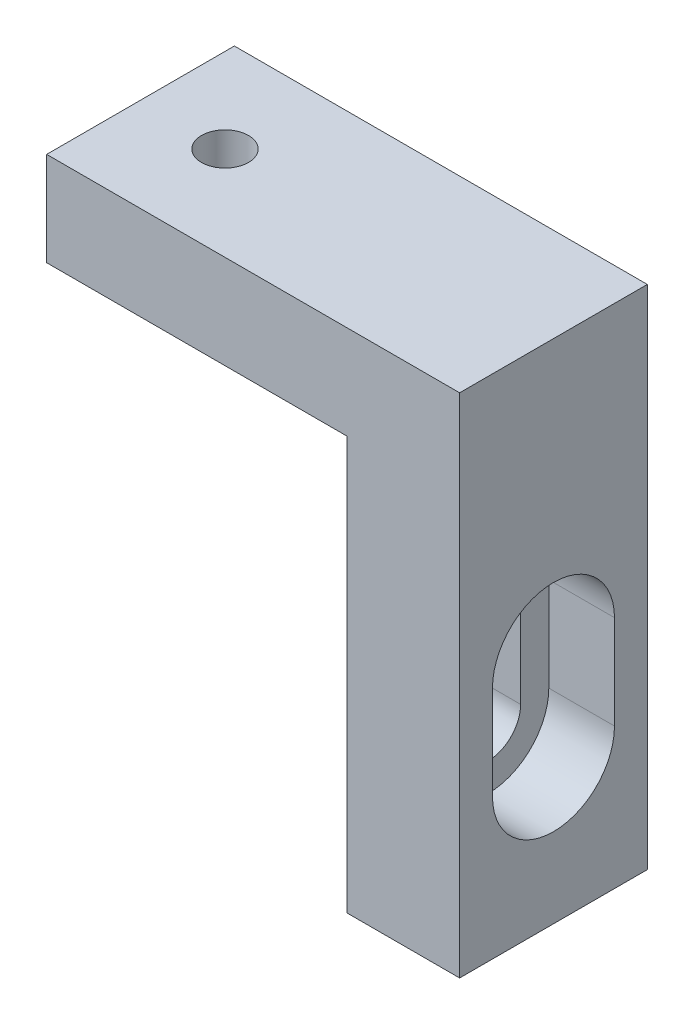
ISO-10303-21;
HEADER;
FILE_DESCRIPTION(('STEP AP214'),'2;1');
FILE_NAME('part.step','',(''),(''),'','','');
FILE_SCHEMA(('AUTOMOTIVE_DESIGN { 1 0 10303 214 1 1 1 1 }'));
ENDSEC;
DATA;
#1=APPLICATION_CONTEXT('core data for automotive mechanical design processes');
#2=APPLICATION_PROTOCOL_DEFINITION('international standard','automotive_design',2000,#1);
#3=PRODUCT_CONTEXT('',#1,'mechanical');
#4=PRODUCT('Part','Part','',(#3));
#5=PRODUCT_RELATED_PRODUCT_CATEGORY('part','',(#4));
#6=PRODUCT_DEFINITION_FORMATION('','',#4);
#7=PRODUCT_DEFINITION_CONTEXT('part definition',#1,'design');
#8=PRODUCT_DEFINITION('design','',#6,#7);
#9=PRODUCT_DEFINITION_SHAPE('','',#8);
#10=(LENGTH_UNIT() NAMED_UNIT(*) SI_UNIT(.MILLI.,.METRE.));
#11=(NAMED_UNIT(*) PLANE_ANGLE_UNIT() SI_UNIT($,.RADIAN.));
#12=(NAMED_UNIT(*) SI_UNIT($,.STERADIAN.) SOLID_ANGLE_UNIT());
#13=UNCERTAINTY_MEASURE_WITH_UNIT(LENGTH_MEASURE(1.E-05),#10,'distance_accuracy_value','');
#14=(GEOMETRIC_REPRESENTATION_CONTEXT(3) GLOBAL_UNCERTAINTY_ASSIGNED_CONTEXT((#13)) GLOBAL_UNIT_ASSIGNED_CONTEXT((#10,
#11,#12)) REPRESENTATION_CONTEXT('',''));
#15=CARTESIAN_POINT('',(0.,0.,0.));
#16=DIRECTION('',(0.,0.,1.));
#17=DIRECTION('',(1.,0.,0.));
#18=AXIS2_PLACEMENT_3D('',#15,#16,#17);
#19=CARTESIAN_POINT('',(12.0000000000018,7.49999999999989,5.));
#20=DIRECTION('',(1.,0.,0.));
#21=DIRECTION('',(0.,0.,-1.));
#22=AXIS2_PLACEMENT_3D('',#19,#20,#21);
#23=CYLINDRICAL_SURFACE('',#22,1.75);
#24=CARTESIAN_POINT('',(18.5000000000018,7.49999999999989,5.));
#25=DIRECTION('',(1.,0.,0.));
#26=DIRECTION('',(0.,0.,-1.));
#27=AXIS2_PLACEMENT_3D('',#24,#25,#26);
#28=CIRCLE('',#27,1.75);
#29=CARTESIAN_POINT('',(18.5000000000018,7.5,3.25));
#30=VERTEX_POINT('',#29);
#31=CARTESIAN_POINT('',(18.5000000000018,7.5,6.75));
#32=VERTEX_POINT('',#31);
#33=EDGE_CURVE('E176',#30,#32,#28,.F.);
#34=ORIENTED_EDGE('',*,*,#33,.F.);
#35=DIRECTION('',(1.,0.,0.));
#36=VECTOR('',#35,1.);
#37=CARTESIAN_POINT('',(12.0000000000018,7.5,3.25));
#38=LINE('',#37,#36);
#39=CARTESIAN_POINT('',(16.0000000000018,7.5,3.25));
#40=VERTEX_POINT('',#39);
#41=EDGE_CURVE('E178',#40,#30,#38,.T.);
#42=ORIENTED_EDGE('',*,*,#41,.F.);
#43=CARTESIAN_POINT('',(16.0000000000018,7.49999999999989,5.));
#44=DIRECTION('',(1.,0.,0.));
#45=DIRECTION('',(0.,0.,-1.));
#46=AXIS2_PLACEMENT_3D('',#43,#44,#45);
#47=CIRCLE('',#46,1.75);
#48=CARTESIAN_POINT('',(16.0000000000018,7.5,6.75));
#49=VERTEX_POINT('',#48);
#50=EDGE_CURVE('E41',#49,#40,#47,.T.);
#51=ORIENTED_EDGE('',*,*,#50,.F.);
#52=DIRECTION('',(1.,0.,0.));
#53=VECTOR('',#52,1.);
#54=CARTESIAN_POINT('',(12.0000000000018,7.5,6.75));
#55=LINE('',#54,#53);
#56=EDGE_CURVE('E179',#49,#32,#55,.T.);
#57=ORIENTED_EDGE('',*,*,#56,.T.);
#58=EDGE_LOOP('',(#34,#42,#51,#57));
#59=FACE_BOUND('',#58,.T.);
#60=ADVANCED_FACE('F32',(#59),#23,.F.);
#61=CARTESIAN_POINT('',(12.0000000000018,7.5,6.75));
#62=DIRECTION('',(0.,0.,1.));
#63=DIRECTION('',(1.,0.,0.));
#64=AXIS2_PLACEMENT_3D('',#61,#62,#63);
#65=PLANE('',#64);
#66=DIRECTION('',(0.,1.,0.));
#67=VECTOR('',#66,1.);
#68=CARTESIAN_POINT('',(18.5000000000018,7.5,6.75));
#69=LINE('',#68,#67);
#70=CARTESIAN_POINT('',(18.5000000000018,12.5,6.75));
#71=VERTEX_POINT('',#70);
#72=EDGE_CURVE('E174',#32,#71,#69,.T.);
#73=ORIENTED_EDGE('',*,*,#72,.F.);
#74=ORIENTED_EDGE('',*,*,#56,.F.);
#75=DIRECTION('',(0.,-1.,0.));
#76=VECTOR('',#75,1.);
#77=CARTESIAN_POINT('',(16.0000000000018,-4.54747350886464E-13,6.75));
#78=LINE('',#77,#76);
#79=CARTESIAN_POINT('',(16.0000000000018,12.5,6.75));
#80=VERTEX_POINT('',#79);
#81=EDGE_CURVE('E240',#80,#49,#78,.T.);
#82=ORIENTED_EDGE('',*,*,#81,.F.);
#83=DIRECTION('',(1.,0.,0.));
#84=VECTOR('',#83,1.);
#85=CARTESIAN_POINT('',(12.0000000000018,12.5,6.75));
#86=LINE('',#85,#84);
#87=EDGE_CURVE('E183',#80,#71,#86,.T.);
#88=ORIENTED_EDGE('',*,*,#87,.T.);
#89=EDGE_LOOP('',(#73,#74,#82,#88));
#90=FACE_BOUND('',#89,.T.);
#91=ADVANCED_FACE('F253',(#90),#65,.F.);
#92=CARTESIAN_POINT('',(12.0000000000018,12.4999999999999,5.));
#93=DIRECTION('',(1.,0.,0.));
#94=DIRECTION('',(0.,0.,-1.));
#95=AXIS2_PLACEMENT_3D('',#92,#93,#94);
#96=CYLINDRICAL_SURFACE('',#95,1.75);
#97=CARTESIAN_POINT('',(18.5000000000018,12.4999999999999,5.));
#98=DIRECTION('',(1.,0.,0.));
#99=DIRECTION('',(0.,0.,-1.));
#100=AXIS2_PLACEMENT_3D('',#97,#98,#99);
#101=CIRCLE('',#100,1.75);
#102=CARTESIAN_POINT('',(18.5000000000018,12.5,3.25));
#103=VERTEX_POINT('',#102);
#104=EDGE_CURVE('E55',#71,#103,#101,.F.);
#105=ORIENTED_EDGE('',*,*,#104,.F.);
#106=ORIENTED_EDGE('',*,*,#87,.F.);
#107=CARTESIAN_POINT('',(16.0000000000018,12.4999999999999,5.));
#108=DIRECTION('',(1.,0.,0.));
#109=DIRECTION('',(0.,0.,-1.));
#110=AXIS2_PLACEMENT_3D('',#107,#108,#109);
#111=CIRCLE('',#110,1.75);
#112=CARTESIAN_POINT('',(16.0000000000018,12.5,3.25));
#113=VERTEX_POINT('',#112);
#114=EDGE_CURVE('E237',#113,#80,#111,.T.);
#115=ORIENTED_EDGE('',*,*,#114,.F.);
#116=DIRECTION('',(1.,0.,0.));
#117=VECTOR('',#116,1.);
#118=CARTESIAN_POINT('',(12.0000000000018,12.5,3.25));
#119=LINE('',#118,#117);
#120=EDGE_CURVE('E186',#113,#103,#119,.T.);
#121=ORIENTED_EDGE('',*,*,#120,.T.);
#122=EDGE_LOOP('',(#105,#106,#115,#121));
#123=FACE_BOUND('',#122,.T.);
#124=ADVANCED_FACE('F256',(#123),#96,.F.);
#125=CARTESIAN_POINT('',(12.0000000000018,7.5,3.25));
#126=DIRECTION('',(0.,0.,-1.));
#127=DIRECTION('',(-1.,0.,0.));
#128=AXIS2_PLACEMENT_3D('',#125,#126,#127);
#129=PLANE('',#128);
#130=DIRECTION('',(0.,-1.,0.));
#131=VECTOR('',#130,1.);
#132=CARTESIAN_POINT('',(18.5000000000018,7.5,3.25));
#133=LINE('',#132,#131);
#134=EDGE_CURVE('E11',#103,#30,#133,.T.);
#135=ORIENTED_EDGE('',*,*,#134,.F.);
#136=ORIENTED_EDGE('',*,*,#120,.F.);
#137=DIRECTION('',(0.,1.,0.));
#138=VECTOR('',#137,1.);
#139=CARTESIAN_POINT('',(16.0000000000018,-4.54747350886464E-13,3.25));
#140=LINE('',#139,#138);
#141=EDGE_CURVE('E234',#40,#113,#140,.T.);
#142=ORIENTED_EDGE('',*,*,#141,.F.);
#143=ORIENTED_EDGE('',*,*,#41,.T.);
#144=EDGE_LOOP('',(#135,#136,#142,#143));
#145=FACE_BOUND('',#144,.T.);
#146=ADVANCED_FACE('F259',(#145),#129,.F.);
#147=CARTESIAN_POINT('',(16.0000000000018,-4.54747350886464E-13,10.));
#148=DIRECTION('',(0.,1.,0.));
#149=DIRECTION('',(0.,0.,1.));
#150=AXIS2_PLACEMENT_3D('',#147,#148,#149);
#151=PLANE('',#150);
#152=DIRECTION('',(1.,0.,0.));
#153=VECTOR('',#152,1.);
#154=CARTESIAN_POINT('',(16.0000000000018,-4.54747350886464E-13,0.));
#155=LINE('',#154,#153);
#156=CARTESIAN_POINT('',(16.0000000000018,-4.54747350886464E-13,0.));
#157=VERTEX_POINT('',#156);
#158=CARTESIAN_POINT('',(22.0000000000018,-4.54747350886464E-13,0.));
#159=VERTEX_POINT('',#158);
#160=EDGE_CURVE('E182',#157,#159,#155,.T.);
#161=ORIENTED_EDGE('',*,*,#160,.T.);
#162=DIRECTION('',(0.,0.,-1.));
#163=VECTOR('',#162,1.);
#164=CARTESIAN_POINT('',(22.0000000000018,-4.54747350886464E-13,10.));
#165=LINE('',#164,#163);
#166=CARTESIAN_POINT('',(22.0000000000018,-4.54747350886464E-13,10.));
#167=VERTEX_POINT('',#166);
#168=EDGE_CURVE('E231',#167,#159,#165,.T.);
#169=ORIENTED_EDGE('',*,*,#168,.F.);
#170=DIRECTION('',(1.,0.,0.));
#171=VECTOR('',#170,1.);
#172=CARTESIAN_POINT('',(16.0000000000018,-4.54747350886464E-13,10.));
#173=LINE('',#172,#171);
#174=CARTESIAN_POINT('',(16.0000000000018,-4.54747350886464E-13,10.));
#175=VERTEX_POINT('',#174);
#176=EDGE_CURVE('E191',#175,#167,#173,.T.);
#177=ORIENTED_EDGE('',*,*,#176,.F.);
#178=DIRECTION('',(0.,0.,-1.));
#179=VECTOR('',#178,1.);
#180=CARTESIAN_POINT('',(16.0000000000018,-4.54747350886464E-13,10.));
#181=LINE('',#180,#179);
#182=EDGE_CURVE('E205',#175,#157,#181,.T.);
#183=ORIENTED_EDGE('',*,*,#182,.T.);
#184=EDGE_LOOP('',(#161,#169,#177,#183));
#185=FACE_BOUND('',#184,.T.);
#186=ADVANCED_FACE('F34',(#185),#151,.F.);
#187=CARTESIAN_POINT('',(22.0000000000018,-4.54747350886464E-13,10.));
#188=DIRECTION('',(-1.,0.,0.));
#189=DIRECTION('',(0.,0.,1.));
#190=AXIS2_PLACEMENT_3D('',#187,#188,#189);
#191=PLANE('',#190);
#192=DIRECTION('',(0.,1.,0.));
#193=VECTOR('',#192,1.);
#194=CARTESIAN_POINT('',(22.0000000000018,7.5,1.75));
#195=LINE('',#194,#193);
#196=CARTESIAN_POINT('',(22.0000000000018,7.5,1.75));
#197=VERTEX_POINT('',#196);
#198=CARTESIAN_POINT('',(22.0000000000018,12.5,1.75));
#199=VERTEX_POINT('',#198);
#200=EDGE_CURVE('E164',#197,#199,#195,.T.);
#201=ORIENTED_EDGE('',*,*,#200,.F.);
#202=CARTESIAN_POINT('',(22.0000000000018,7.49999999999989,5.));
#203=DIRECTION('',(1.,0.,0.));
#204=DIRECTION('',(0.,0.,-1.));
#205=AXIS2_PLACEMENT_3D('',#202,#203,#204);
#206=CIRCLE('',#205,3.25);
#207=CARTESIAN_POINT('',(22.0000000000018,7.5,8.25));
#208=VERTEX_POINT('',#207);
#209=EDGE_CURVE('E48',#208,#197,#206,.T.);
#210=ORIENTED_EDGE('',*,*,#209,.F.);
#211=DIRECTION('',(0.,-1.,0.));
#212=VECTOR('',#211,1.);
#213=CARTESIAN_POINT('',(22.0000000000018,7.5,8.25));
#214=LINE('',#213,#212);
#215=CARTESIAN_POINT('',(22.0000000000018,12.5,8.25));
#216=VERTEX_POINT('',#215);
#217=EDGE_CURVE('E153',#216,#208,#214,.T.);
#218=ORIENTED_EDGE('',*,*,#217,.F.);
#219=CARTESIAN_POINT('',(22.0000000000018,12.4999999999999,5.));
#220=DIRECTION('',(1.,0.,0.));
#221=DIRECTION('',(0.,0.,-1.));
#222=AXIS2_PLACEMENT_3D('',#219,#220,#221);
#223=CIRCLE('',#222,3.25);
#224=EDGE_CURVE('E156',#199,#216,#223,.T.);
#225=ORIENTED_EDGE('',*,*,#224,.F.);
#226=EDGE_LOOP('',(#201,#210,#218,#225));
#227=FACE_BOUND('',#226,.T.);
#228=DIRECTION('',(0.,1.,0.));
#229=VECTOR('',#228,1.);
#230=CARTESIAN_POINT('',(22.0000000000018,-4.54747350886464E-13,0.));
#231=LINE('',#230,#229);
#232=CARTESIAN_POINT('',(22.0000000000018,26.9999999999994,0.));
#233=VERTEX_POINT('',#232);
#234=EDGE_CURVE('E208',#159,#233,#231,.T.);
#235=ORIENTED_EDGE('',*,*,#234,.T.);
#236=DIRECTION('',(0.,0.,-1.));
#237=VECTOR('',#236,1.);
#238=CARTESIAN_POINT('',(22.0000000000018,26.9999999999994,10.));
#239=LINE('',#238,#237);
#240=CARTESIAN_POINT('',(22.0000000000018,26.9999999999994,10.));
#241=VERTEX_POINT('',#240);
#242=EDGE_CURVE('E228',#241,#233,#239,.T.);
#243=ORIENTED_EDGE('',*,*,#242,.F.);
#244=DIRECTION('',(0.,1.,0.));
#245=VECTOR('',#244,1.);
#246=CARTESIAN_POINT('',(22.0000000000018,-4.54747350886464E-13,10.));
#247=LINE('',#246,#245);
#248=EDGE_CURVE('E194',#167,#241,#247,.T.);
#249=ORIENTED_EDGE('',*,*,#248,.F.);
#250=ORIENTED_EDGE('',*,*,#168,.T.);
#251=EDGE_LOOP('',(#235,#243,#249,#250));
#252=FACE_BOUND('',#251,.T.);
#253=ADVANCED_FACE('F266',(#227,#252),#191,.F.);
#254=CARTESIAN_POINT('',(1.81898940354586E-12,26.9999999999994,10.));
#255=DIRECTION('',(0.,-1.,0.));
#256=DIRECTION('',(0.,0.,-1.));
#257=AXIS2_PLACEMENT_3D('',#254,#255,#256);
#258=PLANE('',#257);
#259=CARTESIAN_POINT('',(4.5,26.9999999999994,5.));
#260=DIRECTION('',(0.,1.,0.));
#261=DIRECTION('',(0.,0.,1.));
#262=AXIS2_PLACEMENT_3D('',#259,#260,#261);
#263=CIRCLE('',#262,1.25);
#264=CARTESIAN_POINT('',(4.5,26.9999999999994,6.25));
#265=VERTEX_POINT('',#264);
#266=EDGE_CURVE('E159',#265,#265,#263,.T.);
#267=ORIENTED_EDGE('',*,*,#266,.F.);
#268=EDGE_LOOP('',(#267));
#269=FACE_BOUND('',#268,.T.);
#270=DIRECTION('',(-1.,0.,0.));
#271=VECTOR('',#270,1.);
#272=CARTESIAN_POINT('',(1.81898940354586E-12,26.9999999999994,0.));
#273=LINE('',#272,#271);
#274=CARTESIAN_POINT('',(1.81898940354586E-12,26.9999999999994,0.));
#275=VERTEX_POINT('',#274);
#276=EDGE_CURVE('E210',#233,#275,#273,.T.);
#277=ORIENTED_EDGE('',*,*,#276,.T.);
#278=DIRECTION('',(0.,0.,-1.));
#279=VECTOR('',#278,1.);
#280=CARTESIAN_POINT('',(1.81898940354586E-12,26.9999999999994,10.));
#281=LINE('',#280,#279);
#282=CARTESIAN_POINT('',(1.81898940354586E-12,26.9999999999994,10.));
#283=VERTEX_POINT('',#282);
#284=EDGE_CURVE('E225',#283,#275,#281,.T.);
#285=ORIENTED_EDGE('',*,*,#284,.F.);
#286=DIRECTION('',(-1.,0.,0.));
#287=VECTOR('',#286,1.);
#288=CARTESIAN_POINT('',(1.81898940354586E-12,26.9999999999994,10.));
#289=LINE('',#288,#287);
#290=EDGE_CURVE('E197',#241,#283,#289,.T.);
#291=ORIENTED_EDGE('',*,*,#290,.F.);
#292=ORIENTED_EDGE('',*,*,#242,.T.);
#293=EDGE_LOOP('',(#277,#285,#291,#292));
#294=FACE_BOUND('',#293,.T.);
#295=ADVANCED_FACE('F293',(#269,#294),#258,.F.);
#296=CARTESIAN_POINT('',(1.81898940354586E-12,21.9999999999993,10.));
#297=DIRECTION('',(1.,0.,0.));
#298=DIRECTION('',(0.,0.,-1.));
#299=AXIS2_PLACEMENT_3D('',#296,#297,#298);
#300=PLANE('',#299);
#301=DIRECTION('',(0.,-1.,0.));
#302=VECTOR('',#301,1.);
#303=CARTESIAN_POINT('',(1.81898940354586E-12,21.9999999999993,0.));
#304=LINE('',#303,#302);
#305=CARTESIAN_POINT('',(1.81898940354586E-12,21.9999999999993,0.));
#306=VERTEX_POINT('',#305);
#307=EDGE_CURVE('E212',#275,#306,#304,.T.);
#308=ORIENTED_EDGE('',*,*,#307,.T.);
#309=DIRECTION('',(0.,0.,-1.));
#310=VECTOR('',#309,1.);
#311=CARTESIAN_POINT('',(1.81898940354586E-12,21.9999999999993,10.));
#312=LINE('',#311,#310);
#313=CARTESIAN_POINT('',(1.81898940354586E-12,21.9999999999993,10.));
#314=VERTEX_POINT('',#313);
#315=EDGE_CURVE('E222',#314,#306,#312,.T.);
#316=ORIENTED_EDGE('',*,*,#315,.F.);
#317=DIRECTION('',(0.,-1.,0.));
#318=VECTOR('',#317,1.);
#319=CARTESIAN_POINT('',(1.81898940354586E-12,21.9999999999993,10.));
#320=LINE('',#319,#318);
#321=EDGE_CURVE('E199',#283,#314,#320,.T.);
#322=ORIENTED_EDGE('',*,*,#321,.F.);
#323=ORIENTED_EDGE('',*,*,#284,.T.);
#324=EDGE_LOOP('',(#308,#316,#322,#323));
#325=FACE_BOUND('',#324,.T.);
#326=ADVANCED_FACE('F289',(#325),#300,.F.);
#327=CARTESIAN_POINT('',(1.81898940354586E-12,21.9999999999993,10.));
#328=DIRECTION('',(0.,1.,0.));
#329=DIRECTION('',(-1.,0.,0.));
#330=AXIS2_PLACEMENT_3D('',#327,#328,#329);
#331=PLANE('',#330);
#332=CARTESIAN_POINT('',(4.5,21.9999999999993,5.));
#333=DIRECTION('',(0.,1.,0.));
#334=DIRECTION('',(-1.,0.,0.));
#335=AXIS2_PLACEMENT_3D('',#332,#333,#334);
#336=CIRCLE('',#335,1.25);
#337=CARTESIAN_POINT('',(3.25,21.9999999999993,5.));
#338=VERTEX_POINT('',#337);
#339=EDGE_CURVE('E36',#338,#338,#336,.T.);
#340=ORIENTED_EDGE('',*,*,#339,.T.);
#341=EDGE_LOOP('',(#340));
#342=FACE_BOUND('',#341,.T.);
#343=DIRECTION('',(1.,0.,0.));
#344=VECTOR('',#343,1.);
#345=CARTESIAN_POINT('',(1.81898940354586E-12,21.9999999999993,0.));
#346=LINE('',#345,#344);
#347=CARTESIAN_POINT('',(16.0000000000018,21.9999999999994,0.));
#348=VERTEX_POINT('',#347);
#349=EDGE_CURVE('E214',#306,#348,#346,.T.);
#350=ORIENTED_EDGE('',*,*,#349,.T.);
#351=DIRECTION('',(0.,0.,-1.));
#352=VECTOR('',#351,1.);
#353=CARTESIAN_POINT('',(16.0000000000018,21.9999999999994,10.));
#354=LINE('',#353,#352);
#355=CARTESIAN_POINT('',(16.0000000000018,21.9999999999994,10.));
#356=VERTEX_POINT('',#355);
#357=EDGE_CURVE('E219',#356,#348,#354,.T.);
#358=ORIENTED_EDGE('',*,*,#357,.F.);
#359=DIRECTION('',(1.,0.,0.));
#360=VECTOR('',#359,1.);
#361=CARTESIAN_POINT('',(1.81898940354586E-12,21.9999999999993,10.));
#362=LINE('',#361,#360);
#363=EDGE_CURVE('E201',#314,#356,#362,.T.);
#364=ORIENTED_EDGE('',*,*,#363,.F.);
#365=ORIENTED_EDGE('',*,*,#315,.T.);
#366=EDGE_LOOP('',(#350,#358,#364,#365));
#367=FACE_BOUND('',#366,.T.);
#368=ADVANCED_FACE('F286',(#342,#367),#331,.F.);
#369=CARTESIAN_POINT('',(16.0000000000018,-4.54747350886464E-13,10.));
#370=DIRECTION('',(1.,0.,0.));
#371=DIRECTION('',(0.,0.,-1.));
#372=AXIS2_PLACEMENT_3D('',#369,#370,#371);
#373=PLANE('',#372);
#374=ORIENTED_EDGE('',*,*,#81,.T.);
#375=ORIENTED_EDGE('',*,*,#50,.T.);
#376=ORIENTED_EDGE('',*,*,#141,.T.);
#377=ORIENTED_EDGE('',*,*,#114,.T.);
#378=EDGE_LOOP('',(#374,#375,#376,#377));
#379=FACE_BOUND('',#378,.T.);
#380=DIRECTION('',(0.,-1.,0.));
#381=VECTOR('',#380,1.);
#382=CARTESIAN_POINT('',(16.0000000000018,-4.54747350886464E-13,0.));
#383=LINE('',#382,#381);
#384=EDGE_CURVE('E195',#348,#157,#383,.T.);
#385=ORIENTED_EDGE('',*,*,#384,.T.);
#386=ORIENTED_EDGE('',*,*,#182,.F.);
#387=DIRECTION('',(0.,-1.,0.));
#388=VECTOR('',#387,1.);
#389=CARTESIAN_POINT('',(16.0000000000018,-4.54747350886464E-13,10.));
#390=LINE('',#389,#388);
#391=EDGE_CURVE('E203',#356,#175,#390,.T.);
#392=ORIENTED_EDGE('',*,*,#391,.F.);
#393=ORIENTED_EDGE('',*,*,#357,.T.);
#394=EDGE_LOOP('',(#385,#386,#392,#393));
#395=FACE_BOUND('',#394,.T.);
#396=ADVANCED_FACE('F245',(#379,#395),#373,.F.);
#397=CARTESIAN_POINT('',(22.0000000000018,-4.54747350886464E-13,10.));
#398=DIRECTION('',(0.,0.,1.));
#399=DIRECTION('',(1.,0.,0.));
#400=AXIS2_PLACEMENT_3D('',#397,#398,#399);
#401=PLANE('',#400);
#402=ORIENTED_EDGE('',*,*,#176,.T.);
#403=ORIENTED_EDGE('',*,*,#248,.T.);
#404=ORIENTED_EDGE('',*,*,#290,.T.);
#405=ORIENTED_EDGE('',*,*,#321,.T.);
#406=ORIENTED_EDGE('',*,*,#363,.T.);
#407=ORIENTED_EDGE('',*,*,#391,.T.);
#408=EDGE_LOOP('',(#402,#403,#404,#405,#406,#407));
#409=FACE_BOUND('',#408,.T.);
#410=ADVANCED_FACE('F276',(#409),#401,.T.);
#411=CARTESIAN_POINT('',(22.0000000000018,-4.54747350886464E-13,0.));
#412=DIRECTION('',(0.,0.,1.));
#413=DIRECTION('',(1.,0.,0.));
#414=AXIS2_PLACEMENT_3D('',#411,#412,#413);
#415=PLANE('',#414);
#416=ORIENTED_EDGE('',*,*,#160,.F.);
#417=ORIENTED_EDGE('',*,*,#384,.F.);
#418=ORIENTED_EDGE('',*,*,#349,.F.);
#419=ORIENTED_EDGE('',*,*,#307,.F.);
#420=ORIENTED_EDGE('',*,*,#276,.F.);
#421=ORIENTED_EDGE('',*,*,#234,.F.);
#422=EDGE_LOOP('',(#416,#417,#418,#419,#420,#421));
#423=FACE_BOUND('',#422,.T.);
#424=ADVANCED_FACE('F279',(#423),#415,.F.);
#425=CARTESIAN_POINT('',(18.5000000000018,7.49999999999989,5.));
#426=DIRECTION('',(1.,0.,0.));
#427=DIRECTION('',(0.,0.,-1.));
#428=AXIS2_PLACEMENT_3D('',#425,#426,#427);
#429=PLANE('',#428);
#430=CARTESIAN_POINT('',(18.5000000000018,7.49999999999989,5.));
#431=DIRECTION('',(1.,0.,0.));
#432=DIRECTION('',(0.,0.,-1.));
#433=AXIS2_PLACEMENT_3D('',#430,#431,#432);
#434=CIRCLE('',#433,3.25);
#435=CARTESIAN_POINT('',(18.5000000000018,7.5,8.25));
#436=VERTEX_POINT('',#435);
#437=CARTESIAN_POINT('',(18.5000000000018,7.5,1.75));
#438=VERTEX_POINT('',#437);
#439=EDGE_CURVE('E135',#436,#438,#434,.T.);
#440=ORIENTED_EDGE('',*,*,#439,.T.);
#441=DIRECTION('',(0.,1.,0.));
#442=VECTOR('',#441,1.);
#443=CARTESIAN_POINT('',(18.5000000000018,7.5,1.75));
#444=LINE('',#443,#442);
#445=CARTESIAN_POINT('',(18.5000000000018,12.5,1.75));
#446=VERTEX_POINT('',#445);
#447=EDGE_CURVE('E144',#438,#446,#444,.T.);
#448=ORIENTED_EDGE('',*,*,#447,.T.);
#449=CARTESIAN_POINT('',(18.5000000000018,12.4999999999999,5.));
#450=DIRECTION('',(1.,0.,0.));
#451=DIRECTION('',(0.,0.,-1.));
#452=AXIS2_PLACEMENT_3D('',#449,#450,#451);
#453=CIRCLE('',#452,3.25);
#454=CARTESIAN_POINT('',(18.5000000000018,12.5,8.25));
#455=VERTEX_POINT('',#454);
#456=EDGE_CURVE('E149',#446,#455,#453,.T.);
#457=ORIENTED_EDGE('',*,*,#456,.T.);
#458=DIRECTION('',(0.,-1.,0.));
#459=VECTOR('',#458,1.);
#460=CARTESIAN_POINT('',(18.5000000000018,7.5,8.25));
#461=LINE('',#460,#459);
#462=EDGE_CURVE('E141',#455,#436,#461,.T.);
#463=ORIENTED_EDGE('',*,*,#462,.T.);
#464=EDGE_LOOP('',(#440,#448,#457,#463));
#465=FACE_BOUND('',#464,.T.);
#466=ORIENTED_EDGE('',*,*,#33,.T.);
#467=ORIENTED_EDGE('',*,*,#72,.T.);
#468=ORIENTED_EDGE('',*,*,#104,.T.);
#469=ORIENTED_EDGE('',*,*,#134,.T.);
#470=EDGE_LOOP('',(#466,#467,#468,#469));
#471=FACE_BOUND('',#470,.T.);
#472=ADVANCED_FACE('F151',(#465,#471),#429,.T.);
#473=CARTESIAN_POINT('',(18.5000000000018,7.49999999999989,5.));
#474=DIRECTION('',(1.,0.,0.));
#475=DIRECTION('',(0.,0.,-1.));
#476=AXIS2_PLACEMENT_3D('',#473,#474,#475);
#477=CYLINDRICAL_SURFACE('',#476,3.25);
#478=ORIENTED_EDGE('',*,*,#209,.T.);
#479=DIRECTION('',(1.,0.,0.));
#480=VECTOR('',#479,1.);
#481=CARTESIAN_POINT('',(18.5000000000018,7.5,1.75));
#482=LINE('',#481,#480);
#483=EDGE_CURVE('E131',#438,#197,#482,.T.);
#484=ORIENTED_EDGE('',*,*,#483,.F.);
#485=ORIENTED_EDGE('',*,*,#439,.F.);
#486=DIRECTION('',(1.,0.,0.));
#487=VECTOR('',#486,1.);
#488=CARTESIAN_POINT('',(18.5000000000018,7.5,8.25));
#489=LINE('',#488,#487);
#490=EDGE_CURVE('E168',#436,#208,#489,.T.);
#491=ORIENTED_EDGE('',*,*,#490,.T.);
#492=EDGE_LOOP('',(#478,#484,#485,#491));
#493=FACE_BOUND('',#492,.T.);
#494=ADVANCED_FACE('F133',(#493),#477,.F.);
#495=CARTESIAN_POINT('',(18.5000000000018,7.5,8.25));
#496=DIRECTION('',(0.,0.,1.));
#497=DIRECTION('',(1.,0.,0.));
#498=AXIS2_PLACEMENT_3D('',#495,#496,#497);
#499=PLANE('',#498);
#500=ORIENTED_EDGE('',*,*,#217,.T.);
#501=ORIENTED_EDGE('',*,*,#490,.F.);
#502=ORIENTED_EDGE('',*,*,#462,.F.);
#503=DIRECTION('',(1.,0.,0.));
#504=VECTOR('',#503,1.);
#505=CARTESIAN_POINT('',(18.5000000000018,12.5,8.25));
#506=LINE('',#505,#504);
#507=EDGE_CURVE('E170',#455,#216,#506,.T.);
#508=ORIENTED_EDGE('',*,*,#507,.T.);
#509=EDGE_LOOP('',(#500,#501,#502,#508));
#510=FACE_BOUND('',#509,.T.);
#511=ADVANCED_FACE('F325',(#510),#499,.F.);
#512=CARTESIAN_POINT('',(18.5000000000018,12.4999999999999,5.));
#513=DIRECTION('',(1.,0.,0.));
#514=DIRECTION('',(0.,0.,-1.));
#515=AXIS2_PLACEMENT_3D('',#512,#513,#514);
#516=CYLINDRICAL_SURFACE('',#515,3.25);
#517=ORIENTED_EDGE('',*,*,#224,.T.);
#518=ORIENTED_EDGE('',*,*,#507,.F.);
#519=ORIENTED_EDGE('',*,*,#456,.F.);
#520=DIRECTION('',(1.,0.,0.));
#521=VECTOR('',#520,1.);
#522=CARTESIAN_POINT('',(18.5000000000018,12.5,1.75));
#523=LINE('',#522,#521);
#524=EDGE_CURVE('E140',#446,#199,#523,.T.);
#525=ORIENTED_EDGE('',*,*,#524,.T.);
#526=EDGE_LOOP('',(#517,#518,#519,#525));
#527=FACE_BOUND('',#526,.T.);
#528=ADVANCED_FACE('F323',(#527),#516,.F.);
#529=CARTESIAN_POINT('',(18.5000000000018,7.5,1.75));
#530=DIRECTION('',(0.,0.,-1.));
#531=DIRECTION('',(-1.,0.,0.));
#532=AXIS2_PLACEMENT_3D('',#529,#530,#531);
#533=PLANE('',#532);
#534=ORIENTED_EDGE('',*,*,#200,.T.);
#535=ORIENTED_EDGE('',*,*,#524,.F.);
#536=ORIENTED_EDGE('',*,*,#447,.F.);
#537=ORIENTED_EDGE('',*,*,#483,.T.);
#538=EDGE_LOOP('',(#534,#535,#536,#537));
#539=FACE_BOUND('',#538,.T.);
#540=ADVANCED_FACE('F145',(#539),#533,.F.);
#541=CARTESIAN_POINT('',(4.5,-4.54497550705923E-13,5.));
#542=DIRECTION('',(0.,1.,0.));
#543=DIRECTION('',(0.,0.,1.));
#544=AXIS2_PLACEMENT_3D('',#541,#542,#543);
#545=CYLINDRICAL_SURFACE('',#544,1.25);
#546=ORIENTED_EDGE('',*,*,#266,.T.);
#547=EDGE_LOOP('',(#546));
#548=FACE_BOUND('',#547,.T.);
#549=ORIENTED_EDGE('',*,*,#339,.F.);
#550=EDGE_LOOP('',(#549));
#551=FACE_BOUND('',#550,.T.);
#552=ADVANCED_FACE('F338',(#548,#551),#545,.F.);
#553=CLOSED_SHELL('',(#60,#91,#124,#146,#186,#253,#295,#326,#368,#396,#410,#424,#472,#494,#511,
#528,#540,#552));
#554=MANIFOLD_SOLID_BREP('B2',#553);
#555=ADVANCED_BREP_SHAPE_REPRESENTATION('',(#18,#554),#14);
#556=SHAPE_DEFINITION_REPRESENTATION(#9,#555);
ENDSEC;
END-ISO-10303-21;
